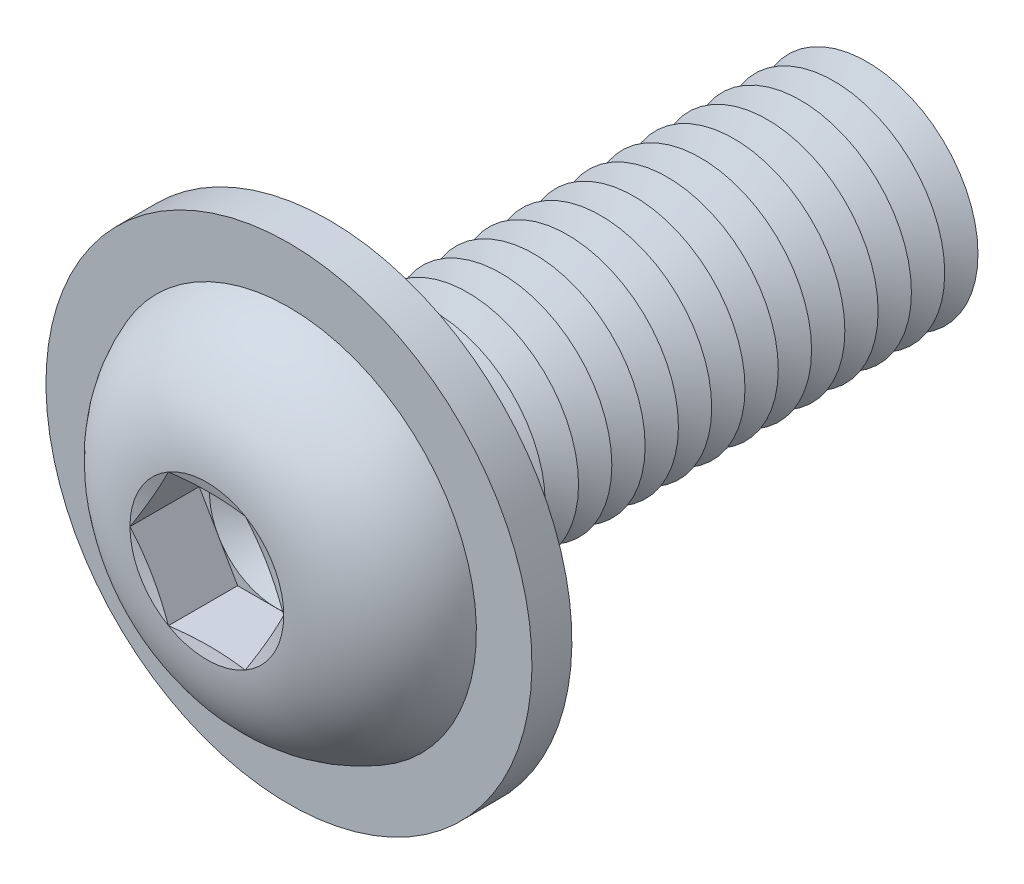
ISO-10303-21;
HEADER;
FILE_DESCRIPTION(('STEP AP214'),'2;1');
FILE_NAME('part.step','',(''),(''),'','','');
FILE_SCHEMA(('AUTOMOTIVE_DESIGN { 1 0 10303 214 1 1 1 1 }'));
ENDSEC;
DATA;
#1=APPLICATION_CONTEXT('core data for automotive mechanical design processes');
#2=APPLICATION_PROTOCOL_DEFINITION('international standard','automotive_design',2000,#1);
#3=PRODUCT_CONTEXT('',#1,'mechanical');
#4=PRODUCT('Part','Part','',(#3));
#5=PRODUCT_RELATED_PRODUCT_CATEGORY('part','',(#4));
#6=PRODUCT_DEFINITION_FORMATION('','',#4);
#7=PRODUCT_DEFINITION_CONTEXT('part definition',#1,'design');
#8=PRODUCT_DEFINITION('design','',#6,#7);
#9=PRODUCT_DEFINITION_SHAPE('','',#8);
#10=(LENGTH_UNIT() NAMED_UNIT(*) SI_UNIT(.MILLI.,.METRE.));
#11=(NAMED_UNIT(*) PLANE_ANGLE_UNIT() SI_UNIT($,.RADIAN.));
#12=(NAMED_UNIT(*) SI_UNIT($,.STERADIAN.) SOLID_ANGLE_UNIT());
#13=UNCERTAINTY_MEASURE_WITH_UNIT(LENGTH_MEASURE(1.E-05),#10,'distance_accuracy_value','');
#14=(GEOMETRIC_REPRESENTATION_CONTEXT(3) GLOBAL_UNCERTAINTY_ASSIGNED_CONTEXT((#13)) GLOBAL_UNIT_ASSIGNED_CONTEXT((#10,
#11,#12)) REPRESENTATION_CONTEXT('',''));
#15=CARTESIAN_POINT('',(0.,0.,0.));
#16=DIRECTION('',(0.,0.,1.));
#17=DIRECTION('',(1.,0.,0.));
#18=AXIS2_PLACEMENT_3D('',#15,#16,#17);
#19=CARTESIAN_POINT('',(0.,0.,-19.75));
#20=DIRECTION('',(0.,0.,1.));
#21=DIRECTION('',(1.,0.,0.));
#22=AXIS2_PLACEMENT_3D('',#19,#20,#21);
#23=CONICAL_SURFACE('',#22,5.,1.0471975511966);
#24=CARTESIAN_POINT('',(0.,0.,-20.5));
#25=DIRECTION('',(0.,0.,1.));
#26=DIRECTION('',(1.,0.,0.));
#27=AXIS2_PLACEMENT_3D('',#24,#25,#26);
#28=CIRCLE('',#27,3.70096189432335);
#29=CARTESIAN_POINT('',(3.70096189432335,0.,-20.5));
#30=VERTEX_POINT('',#29);
#31=EDGE_CURVE('E363',#30,#30,#28,.T.);
#32=ORIENTED_EDGE('',*,*,#31,.T.);
#33=EDGE_LOOP('',(#32));
#34=FACE_BOUND('',#33,.T.);
#35=CARTESIAN_POINT('',(0.,0.,-19.75));
#36=DIRECTION('',(0.,0.,1.));
#37=DIRECTION('',(1.,0.,0.));
#38=AXIS2_PLACEMENT_3D('',#35,#36,#37);
#39=CIRCLE('',#38,5.);
#40=CARTESIAN_POINT('',(5.,0.,-19.75));
#41=VERTEX_POINT('',#40);
#42=EDGE_CURVE('E337',#41,#41,#39,.T.);
#43=ORIENTED_EDGE('',*,*,#42,.F.);
#44=EDGE_LOOP('',(#43));
#45=FACE_BOUND('',#44,.T.);
#46=ADVANCED_FACE('F39',(#34,#45),#23,.T.);
#47=CARTESIAN_POINT('',(0.,0.,-20.5));
#48=DIRECTION('',(0.,0.,-1.));
#49=DIRECTION('',(-1.,0.,0.));
#50=AXIS2_PLACEMENT_3D('',#47,#48,#49);
#51=CONICAL_SURFACE('',#50,3.70096189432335,1.0471975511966);
#52=CARTESIAN_POINT('',(0.,0.,-21.25));
#53=DIRECTION('',(0.,0.,1.));
#54=DIRECTION('',(1.,0.,0.));
#55=AXIS2_PLACEMENT_3D('',#52,#53,#54);
#56=CIRCLE('',#55,5.);
#57=CARTESIAN_POINT('',(5.,0.,-21.25));
#58=VERTEX_POINT('',#57);
#59=EDGE_CURVE('E359',#58,#58,#56,.T.);
#60=ORIENTED_EDGE('',*,*,#59,.T.);
#61=EDGE_LOOP('',(#60));
#62=FACE_BOUND('',#61,.T.);
#63=ORIENTED_EDGE('',*,*,#31,.F.);
#64=EDGE_LOOP('',(#63));
#65=FACE_BOUND('',#64,.T.);
#66=ADVANCED_FACE('F433',(#62,#65),#51,.T.);
#67=CARTESIAN_POINT('',(0.,5.00000000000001,-25.));
#68=DIRECTION('',(0.,0.,-1.));
#69=DIRECTION('',(-1.,0.,0.));
#70=AXIS2_PLACEMENT_3D('',#67,#68,#69);
#71=PLANE('',#70);
#72=CARTESIAN_POINT('',(0.,0.,-25.));
#73=DIRECTION('',(0.,0.,1.));
#74=DIRECTION('',(1.,0.,0.));
#75=AXIS2_PLACEMENT_3D('',#72,#73,#74);
#76=CIRCLE('',#75,3.70096189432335);
#77=CARTESIAN_POINT('',(3.70096189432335,0.,-25.));
#78=VERTEX_POINT('',#77);
#79=EDGE_CURVE('E307',#78,#78,#76,.T.);
#80=ORIENTED_EDGE('',*,*,#79,.F.);
#81=EDGE_LOOP('',(#80));
#82=FACE_BOUND('',#81,.T.);
#83=ADVANCED_FACE('F431',(#82),#71,.T.);
#84=CARTESIAN_POINT('',(0.,0.,-24.25));
#85=DIRECTION('',(0.,0.,1.));
#86=DIRECTION('',(1.,0.,0.));
#87=AXIS2_PLACEMENT_3D('',#84,#85,#86);
#88=CONICAL_SURFACE('',#87,5.,1.0471975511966);
#89=ORIENTED_EDGE('',*,*,#79,.T.);
#90=EDGE_LOOP('',(#89));
#91=FACE_BOUND('',#90,.T.);
#92=CARTESIAN_POINT('',(0.,0.,-24.25));
#93=DIRECTION('',(0.,0.,1.));
#94=DIRECTION('',(1.,0.,0.));
#95=AXIS2_PLACEMENT_3D('',#92,#93,#94);
#96=CIRCLE('',#95,5.);
#97=CARTESIAN_POINT('',(5.,0.,-24.25));
#98=VERTEX_POINT('',#97);
#99=EDGE_CURVE('E416',#98,#98,#96,.T.);
#100=ORIENTED_EDGE('',*,*,#99,.F.);
#101=EDGE_LOOP('',(#100));
#102=FACE_BOUND('',#101,.T.);
#103=ADVANCED_FACE('F428',(#91,#102),#88,.T.);
#104=CARTESIAN_POINT('',(0.,0.,-23.5));
#105=DIRECTION('',(0.,0.,-1.));
#106=DIRECTION('',(-1.,0.,0.));
#107=AXIS2_PLACEMENT_3D('',#104,#105,#106);
#108=CONICAL_SURFACE('',#107,3.70096189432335,1.0471975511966);
#109=ORIENTED_EDGE('',*,*,#99,.T.);
#110=EDGE_LOOP('',(#109));
#111=FACE_BOUND('',#110,.T.);
#112=CARTESIAN_POINT('',(0.,0.,-23.5));
#113=DIRECTION('',(0.,0.,1.));
#114=DIRECTION('',(1.,0.,0.));
#115=AXIS2_PLACEMENT_3D('',#112,#113,#114);
#116=CIRCLE('',#115,3.70096189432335);
#117=CARTESIAN_POINT('',(3.70096189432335,0.,-23.5));
#118=VERTEX_POINT('',#117);
#119=EDGE_CURVE('E413',#118,#118,#116,.T.);
#120=ORIENTED_EDGE('',*,*,#119,.F.);
#121=EDGE_LOOP('',(#120));
#122=FACE_BOUND('',#121,.T.);
#123=ADVANCED_FACE('F438',(#111,#122),#108,.T.);
#124=CARTESIAN_POINT('',(0.,0.,-22.75));
#125=DIRECTION('',(0.,0.,1.));
#126=DIRECTION('',(1.,0.,0.));
#127=AXIS2_PLACEMENT_3D('',#124,#125,#126);
#128=CONICAL_SURFACE('',#127,5.,1.0471975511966);
#129=ORIENTED_EDGE('',*,*,#119,.T.);
#130=EDGE_LOOP('',(#129));
#131=FACE_BOUND('',#130,.T.);
#132=CARTESIAN_POINT('',(0.,0.,-22.75));
#133=DIRECTION('',(0.,0.,1.));
#134=DIRECTION('',(1.,0.,0.));
#135=AXIS2_PLACEMENT_3D('',#132,#133,#134);
#136=CIRCLE('',#135,5.);
#137=CARTESIAN_POINT('',(5.,0.,-22.75));
#138=VERTEX_POINT('',#137);
#139=EDGE_CURVE('E409',#138,#138,#136,.T.);
#140=ORIENTED_EDGE('',*,*,#139,.F.);
#141=EDGE_LOOP('',(#140));
#142=FACE_BOUND('',#141,.T.);
#143=ADVANCED_FACE('F454',(#131,#142),#128,.T.);
#144=CARTESIAN_POINT('',(0.,0.,-22.));
#145=DIRECTION('',(0.,0.,-1.));
#146=DIRECTION('',(-1.,0.,0.));
#147=AXIS2_PLACEMENT_3D('',#144,#145,#146);
#148=CONICAL_SURFACE('',#147,3.70096189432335,1.0471975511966);
#149=ORIENTED_EDGE('',*,*,#139,.T.);
#150=EDGE_LOOP('',(#149));
#151=FACE_BOUND('',#150,.T.);
#152=CARTESIAN_POINT('',(0.,0.,-22.));
#153=DIRECTION('',(0.,0.,1.));
#154=DIRECTION('',(1.,0.,0.));
#155=AXIS2_PLACEMENT_3D('',#152,#153,#154);
#156=CIRCLE('',#155,3.70096189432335);
#157=CARTESIAN_POINT('',(3.70096189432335,0.,-22.));
#158=VERTEX_POINT('',#157);
#159=EDGE_CURVE('E362',#158,#158,#156,.T.);
#160=ORIENTED_EDGE('',*,*,#159,.F.);
#161=EDGE_LOOP('',(#160));
#162=FACE_BOUND('',#161,.T.);
#163=ADVANCED_FACE('F450',(#151,#162),#148,.T.);
#164=CARTESIAN_POINT('',(0.,0.,-21.25));
#165=DIRECTION('',(0.,0.,1.));
#166=DIRECTION('',(1.,0.,0.));
#167=AXIS2_PLACEMENT_3D('',#164,#165,#166);
#168=CONICAL_SURFACE('',#167,5.,1.0471975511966);
#169=ORIENTED_EDGE('',*,*,#159,.T.);
#170=EDGE_LOOP('',(#169));
#171=FACE_BOUND('',#170,.T.);
#172=ORIENTED_EDGE('',*,*,#59,.F.);
#173=EDGE_LOOP('',(#172));
#174=FACE_BOUND('',#173,.T.);
#175=ADVANCED_FACE('F453',(#171,#174),#168,.T.);
#176=CARTESIAN_POINT('',(0.,0.,-18.25));
#177=DIRECTION('',(0.,0.,1.));
#178=DIRECTION('',(1.,0.,0.));
#179=AXIS2_PLACEMENT_3D('',#176,#177,#178);
#180=CONICAL_SURFACE('',#179,5.,1.0471975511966);
#181=CARTESIAN_POINT('',(0.,0.,-19.));
#182=DIRECTION('',(0.,0.,1.));
#183=DIRECTION('',(1.,0.,0.));
#184=AXIS2_PLACEMENT_3D('',#181,#182,#183);
#185=CIRCLE('',#184,3.70096189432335);
#186=CARTESIAN_POINT('',(3.70096189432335,0.,-19.));
#187=VERTEX_POINT('',#186);
#188=EDGE_CURVE('E334',#187,#187,#185,.T.);
#189=ORIENTED_EDGE('',*,*,#188,.T.);
#190=EDGE_LOOP('',(#189));
#191=FACE_BOUND('',#190,.T.);
#192=CARTESIAN_POINT('',(0.,0.,-18.25));
#193=DIRECTION('',(0.,0.,1.));
#194=DIRECTION('',(1.,0.,0.));
#195=AXIS2_PLACEMENT_3D('',#192,#193,#194);
#196=CIRCLE('',#195,5.);
#197=CARTESIAN_POINT('',(5.,0.,-18.25));
#198=VERTEX_POINT('',#197);
#199=EDGE_CURVE('E338',#198,#198,#196,.T.);
#200=ORIENTED_EDGE('',*,*,#199,.F.);
#201=EDGE_LOOP('',(#200));
#202=FACE_BOUND('',#201,.T.);
#203=ADVANCED_FACE('F458',(#191,#202),#180,.T.);
#204=CARTESIAN_POINT('',(0.,0.,-19.));
#205=DIRECTION('',(0.,0.,-1.));
#206=DIRECTION('',(-1.,0.,0.));
#207=AXIS2_PLACEMENT_3D('',#204,#205,#206);
#208=CONICAL_SURFACE('',#207,3.70096189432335,1.0471975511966);
#209=ORIENTED_EDGE('',*,*,#42,.T.);
#210=EDGE_LOOP('',(#209));
#211=FACE_BOUND('',#210,.T.);
#212=ORIENTED_EDGE('',*,*,#188,.F.);
#213=EDGE_LOOP('',(#212));
#214=FACE_BOUND('',#213,.T.);
#215=ADVANCED_FACE('F489',(#211,#214),#208,.T.);
#216=CARTESIAN_POINT('',(0.,0.,-16.75));
#217=DIRECTION('',(0.,0.,1.));
#218=DIRECTION('',(1.,0.,0.));
#219=AXIS2_PLACEMENT_3D('',#216,#217,#218);
#220=CONICAL_SURFACE('',#219,5.,1.0471975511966);
#221=CARTESIAN_POINT('',(0.,0.,-17.5));
#222=DIRECTION('',(0.,0.,1.));
#223=DIRECTION('',(1.,0.,0.));
#224=AXIS2_PLACEMENT_3D('',#221,#222,#223);
#225=CIRCLE('',#224,3.70096189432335);
#226=CARTESIAN_POINT('',(3.70096189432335,0.,-17.5));
#227=VERTEX_POINT('',#226);
#228=EDGE_CURVE('E330',#227,#227,#225,.T.);
#229=ORIENTED_EDGE('',*,*,#228,.T.);
#230=EDGE_LOOP('',(#229));
#231=FACE_BOUND('',#230,.T.);
#232=CARTESIAN_POINT('',(0.,0.,-16.75));
#233=DIRECTION('',(0.,0.,1.));
#234=DIRECTION('',(1.,0.,0.));
#235=AXIS2_PLACEMENT_3D('',#232,#233,#234);
#236=CIRCLE('',#235,5.);
#237=CARTESIAN_POINT('',(5.,0.,-16.75));
#238=VERTEX_POINT('',#237);
#239=EDGE_CURVE('E327',#238,#238,#236,.T.);
#240=ORIENTED_EDGE('',*,*,#239,.F.);
#241=EDGE_LOOP('',(#240));
#242=FACE_BOUND('',#241,.T.);
#243=ADVANCED_FACE('F495',(#231,#242),#220,.T.);
#244=CARTESIAN_POINT('',(0.,0.,-17.5));
#245=DIRECTION('',(0.,0.,-1.));
#246=DIRECTION('',(-1.,0.,0.));
#247=AXIS2_PLACEMENT_3D('',#244,#245,#246);
#248=CONICAL_SURFACE('',#247,3.70096189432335,1.0471975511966);
#249=ORIENTED_EDGE('',*,*,#199,.T.);
#250=EDGE_LOOP('',(#249));
#251=FACE_BOUND('',#250,.T.);
#252=ORIENTED_EDGE('',*,*,#228,.F.);
#253=EDGE_LOOP('',(#252));
#254=FACE_BOUND('',#253,.T.);
#255=ADVANCED_FACE('F502',(#251,#254),#248,.T.);
#256=CARTESIAN_POINT('',(0.,0.,-15.25));
#257=DIRECTION('',(0.,0.,1.));
#258=DIRECTION('',(1.,0.,0.));
#259=AXIS2_PLACEMENT_3D('',#256,#257,#258);
#260=CONICAL_SURFACE('',#259,5.,1.0471975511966);
#261=CARTESIAN_POINT('',(0.,0.,-16.));
#262=DIRECTION('',(0.,0.,1.));
#263=DIRECTION('',(1.,0.,0.));
#264=AXIS2_PLACEMENT_3D('',#261,#262,#263);
#265=CIRCLE('',#264,3.70096189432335);
#266=CARTESIAN_POINT('',(3.70096189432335,0.,-16.));
#267=VERTEX_POINT('',#266);
#268=EDGE_CURVE('E331',#267,#267,#265,.T.);
#269=ORIENTED_EDGE('',*,*,#268,.T.);
#270=EDGE_LOOP('',(#269));
#271=FACE_BOUND('',#270,.T.);
#272=CARTESIAN_POINT('',(0.,0.,-15.25));
#273=DIRECTION('',(0.,0.,1.));
#274=DIRECTION('',(1.,0.,0.));
#275=AXIS2_PLACEMENT_3D('',#272,#273,#274);
#276=CIRCLE('',#275,5.);
#277=CARTESIAN_POINT('',(5.,0.,-15.25));
#278=VERTEX_POINT('',#277);
#279=EDGE_CURVE('E343',#278,#278,#276,.T.);
#280=ORIENTED_EDGE('',*,*,#279,.F.);
#281=EDGE_LOOP('',(#280));
#282=FACE_BOUND('',#281,.T.);
#283=ADVANCED_FACE('F509',(#271,#282),#260,.T.);
#284=CARTESIAN_POINT('',(0.,0.,-16.));
#285=DIRECTION('',(0.,0.,-1.));
#286=DIRECTION('',(-1.,0.,0.));
#287=AXIS2_PLACEMENT_3D('',#284,#285,#286);
#288=CONICAL_SURFACE('',#287,3.70096189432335,1.0471975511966);
#289=ORIENTED_EDGE('',*,*,#239,.T.);
#290=EDGE_LOOP('',(#289));
#291=FACE_BOUND('',#290,.T.);
#292=ORIENTED_EDGE('',*,*,#268,.F.);
#293=EDGE_LOOP('',(#292));
#294=FACE_BOUND('',#293,.T.);
#295=ADVANCED_FACE('F516',(#291,#294),#288,.T.);
#296=CARTESIAN_POINT('',(0.,0.,-13.75));
#297=DIRECTION('',(0.,0.,1.));
#298=DIRECTION('',(1.,0.,0.));
#299=AXIS2_PLACEMENT_3D('',#296,#297,#298);
#300=CONICAL_SURFACE('',#299,5.,1.0471975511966);
#301=CARTESIAN_POINT('',(0.,0.,-14.5));
#302=DIRECTION('',(0.,0.,1.));
#303=DIRECTION('',(1.,0.,0.));
#304=AXIS2_PLACEMENT_3D('',#301,#302,#303);
#305=CIRCLE('',#304,3.70096189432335);
#306=CARTESIAN_POINT('',(3.70096189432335,0.,-14.5));
#307=VERTEX_POINT('',#306);
#308=EDGE_CURVE('E340',#307,#307,#305,.T.);
#309=ORIENTED_EDGE('',*,*,#308,.T.);
#310=EDGE_LOOP('',(#309));
#311=FACE_BOUND('',#310,.T.);
#312=CARTESIAN_POINT('',(0.,0.,-13.75));
#313=DIRECTION('',(0.,0.,1.));
#314=DIRECTION('',(1.,0.,0.));
#315=AXIS2_PLACEMENT_3D('',#312,#313,#314);
#316=CIRCLE('',#315,5.);
#317=CARTESIAN_POINT('',(5.,0.,-13.75));
#318=VERTEX_POINT('',#317);
#319=EDGE_CURVE('E344',#318,#318,#316,.T.);
#320=ORIENTED_EDGE('',*,*,#319,.F.);
#321=EDGE_LOOP('',(#320));
#322=FACE_BOUND('',#321,.T.);
#323=ADVANCED_FACE('F523',(#311,#322),#300,.T.);
#324=CARTESIAN_POINT('',(0.,0.,-14.5));
#325=DIRECTION('',(0.,0.,-1.));
#326=DIRECTION('',(-1.,0.,0.));
#327=AXIS2_PLACEMENT_3D('',#324,#325,#326);
#328=CONICAL_SURFACE('',#327,3.70096189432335,1.0471975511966);
#329=ORIENTED_EDGE('',*,*,#279,.T.);
#330=EDGE_LOOP('',(#329));
#331=FACE_BOUND('',#330,.T.);
#332=ORIENTED_EDGE('',*,*,#308,.F.);
#333=EDGE_LOOP('',(#332));
#334=FACE_BOUND('',#333,.T.);
#335=ADVANCED_FACE('F530',(#331,#334),#328,.T.);
#336=CARTESIAN_POINT('',(0.,0.,-12.25));
#337=DIRECTION('',(0.,0.,1.));
#338=DIRECTION('',(1.,0.,0.));
#339=AXIS2_PLACEMENT_3D('',#336,#337,#338);
#340=CONICAL_SURFACE('',#339,5.,1.0471975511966);
#341=CARTESIAN_POINT('',(0.,0.,-13.));
#342=DIRECTION('',(0.,0.,1.));
#343=DIRECTION('',(1.,0.,0.));
#344=AXIS2_PLACEMENT_3D('',#341,#342,#343);
#345=CIRCLE('',#344,3.70096189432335);
#346=CARTESIAN_POINT('',(3.70096189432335,0.,-13.));
#347=VERTEX_POINT('',#346);
#348=EDGE_CURVE('E375',#347,#347,#345,.T.);
#349=ORIENTED_EDGE('',*,*,#348,.T.);
#350=EDGE_LOOP('',(#349));
#351=FACE_BOUND('',#350,.T.);
#352=CARTESIAN_POINT('',(0.,0.,-12.25));
#353=DIRECTION('',(0.,0.,1.));
#354=DIRECTION('',(1.,0.,0.));
#355=AXIS2_PLACEMENT_3D('',#352,#353,#354);
#356=CIRCLE('',#355,5.);
#357=CARTESIAN_POINT('',(5.,0.,-12.25));
#358=VERTEX_POINT('',#357);
#359=EDGE_CURVE('E373',#358,#358,#356,.T.);
#360=ORIENTED_EDGE('',*,*,#359,.F.);
#361=EDGE_LOOP('',(#360));
#362=FACE_BOUND('',#361,.T.);
#363=ADVANCED_FACE('F537',(#351,#362),#340,.T.);
#364=CARTESIAN_POINT('',(0.,0.,-13.));
#365=DIRECTION('',(0.,0.,-1.));
#366=DIRECTION('',(-1.,0.,0.));
#367=AXIS2_PLACEMENT_3D('',#364,#365,#366);
#368=CONICAL_SURFACE('',#367,3.70096189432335,1.0471975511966);
#369=ORIENTED_EDGE('',*,*,#319,.T.);
#370=EDGE_LOOP('',(#369));
#371=FACE_BOUND('',#370,.T.);
#372=ORIENTED_EDGE('',*,*,#348,.F.);
#373=EDGE_LOOP('',(#372));
#374=FACE_BOUND('',#373,.T.);
#375=ADVANCED_FACE('F544',(#371,#374),#368,.T.);
#376=CARTESIAN_POINT('',(0.,0.,-10.75));
#377=DIRECTION('',(0.,0.,1.));
#378=DIRECTION('',(1.,0.,0.));
#379=AXIS2_PLACEMENT_3D('',#376,#377,#378);
#380=CONICAL_SURFACE('',#379,5.,1.0471975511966);
#381=CARTESIAN_POINT('',(0.,0.,-11.5));
#382=DIRECTION('',(0.,0.,1.));
#383=DIRECTION('',(1.,0.,0.));
#384=AXIS2_PLACEMENT_3D('',#381,#382,#383);
#385=CIRCLE('',#384,3.70096189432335);
#386=CARTESIAN_POINT('',(3.70096189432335,0.,-11.5));
#387=VERTEX_POINT('',#386);
#388=EDGE_CURVE('E376',#387,#387,#385,.T.);
#389=ORIENTED_EDGE('',*,*,#388,.T.);
#390=EDGE_LOOP('',(#389));
#391=FACE_BOUND('',#390,.T.);
#392=CARTESIAN_POINT('',(0.,0.,-10.75));
#393=DIRECTION('',(0.,0.,1.));
#394=DIRECTION('',(1.,0.,0.));
#395=AXIS2_PLACEMENT_3D('',#392,#393,#394);
#396=CIRCLE('',#395,5.);
#397=CARTESIAN_POINT('',(5.,0.,-10.75));
#398=VERTEX_POINT('',#397);
#399=EDGE_CURVE('E385',#398,#398,#396,.T.);
#400=ORIENTED_EDGE('',*,*,#399,.F.);
#401=EDGE_LOOP('',(#400));
#402=FACE_BOUND('',#401,.T.);
#403=ADVANCED_FACE('F551',(#391,#402),#380,.T.);
#404=CARTESIAN_POINT('',(0.,0.,-11.5));
#405=DIRECTION('',(0.,0.,-1.));
#406=DIRECTION('',(-1.,0.,0.));
#407=AXIS2_PLACEMENT_3D('',#404,#405,#406);
#408=CONICAL_SURFACE('',#407,3.70096189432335,1.0471975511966);
#409=ORIENTED_EDGE('',*,*,#359,.T.);
#410=EDGE_LOOP('',(#409));
#411=FACE_BOUND('',#410,.T.);
#412=ORIENTED_EDGE('',*,*,#388,.F.);
#413=EDGE_LOOP('',(#412));
#414=FACE_BOUND('',#413,.T.);
#415=ADVANCED_FACE('F558',(#411,#414),#408,.T.);
#416=CARTESIAN_POINT('',(0.,0.,-9.25));
#417=DIRECTION('',(0.,0.,1.));
#418=DIRECTION('',(1.,0.,0.));
#419=AXIS2_PLACEMENT_3D('',#416,#417,#418);
#420=CONICAL_SURFACE('',#419,5.,1.0471975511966);
#421=CARTESIAN_POINT('',(0.,0.,-10.));
#422=DIRECTION('',(0.,0.,1.));
#423=DIRECTION('',(1.,0.,0.));
#424=AXIS2_PLACEMENT_3D('',#421,#422,#423);
#425=CIRCLE('',#424,3.70096189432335);
#426=CARTESIAN_POINT('',(3.70096189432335,0.,-10.));
#427=VERTEX_POINT('',#426);
#428=EDGE_CURVE('E1056',#427,#427,#425,.T.);
#429=ORIENTED_EDGE('',*,*,#428,.T.);
#430=EDGE_LOOP('',(#429));
#431=FACE_BOUND('',#430,.T.);
#432=CARTESIAN_POINT('',(0.,0.,-9.25));
#433=DIRECTION('',(0.,0.,1.));
#434=DIRECTION('',(1.,0.,0.));
#435=AXIS2_PLACEMENT_3D('',#432,#433,#434);
#436=CIRCLE('',#435,5.);
#437=CARTESIAN_POINT('',(5.,0.,-9.25));
#438=VERTEX_POINT('',#437);
#439=EDGE_CURVE('E367',#438,#438,#436,.T.);
#440=ORIENTED_EDGE('',*,*,#439,.F.);
#441=EDGE_LOOP('',(#440));
#442=FACE_BOUND('',#441,.T.);
#443=ADVANCED_FACE('F565',(#431,#442),#420,.T.);
#444=CARTESIAN_POINT('',(0.,0.,-10.));
#445=DIRECTION('',(0.,0.,-1.));
#446=DIRECTION('',(-1.,0.,0.));
#447=AXIS2_PLACEMENT_3D('',#444,#445,#446);
#448=CONICAL_SURFACE('',#447,3.70096189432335,1.0471975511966);
#449=ORIENTED_EDGE('',*,*,#399,.T.);
#450=EDGE_LOOP('',(#449));
#451=FACE_BOUND('',#450,.T.);
#452=ORIENTED_EDGE('',*,*,#428,.F.);
#453=EDGE_LOOP('',(#452));
#454=FACE_BOUND('',#453,.T.);
#455=ADVANCED_FACE('F571',(#451,#454),#448,.T.);
#456=CARTESIAN_POINT('',(0.,0.,-7.75));
#457=DIRECTION('',(0.,0.,1.));
#458=DIRECTION('',(1.,0.,0.));
#459=AXIS2_PLACEMENT_3D('',#456,#457,#458);
#460=CONICAL_SURFACE('',#459,5.,1.0471975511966);
#461=CARTESIAN_POINT('',(0.,0.,-8.5));
#462=DIRECTION('',(0.,0.,1.));
#463=DIRECTION('',(1.,0.,0.));
#464=AXIS2_PLACEMENT_3D('',#461,#462,#463);
#465=CIRCLE('',#464,3.70096189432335);
#466=CARTESIAN_POINT('',(3.70096189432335,0.,-8.5));
#467=VERTEX_POINT('',#466);
#468=EDGE_CURVE('E355',#467,#467,#465,.T.);
#469=ORIENTED_EDGE('',*,*,#468,.T.);
#470=EDGE_LOOP('',(#469));
#471=FACE_BOUND('',#470,.T.);
#472=CARTESIAN_POINT('',(0.,0.,-7.75));
#473=DIRECTION('',(0.,0.,1.));
#474=DIRECTION('',(1.,0.,0.));
#475=AXIS2_PLACEMENT_3D('',#472,#473,#474);
#476=CIRCLE('',#475,5.);
#477=CARTESIAN_POINT('',(5.,0.,-7.75));
#478=VERTEX_POINT('',#477);
#479=EDGE_CURVE('E352',#478,#478,#476,.T.);
#480=ORIENTED_EDGE('',*,*,#479,.F.);
#481=EDGE_LOOP('',(#480));
#482=FACE_BOUND('',#481,.T.);
#483=ADVANCED_FACE('F578',(#471,#482),#460,.T.);
#484=CARTESIAN_POINT('',(0.,0.,-8.5));
#485=DIRECTION('',(0.,0.,-1.));
#486=DIRECTION('',(-1.,0.,0.));
#487=AXIS2_PLACEMENT_3D('',#484,#485,#486);
#488=CONICAL_SURFACE('',#487,3.70096189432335,1.0471975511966);
#489=ORIENTED_EDGE('',*,*,#439,.T.);
#490=EDGE_LOOP('',(#489));
#491=FACE_BOUND('',#490,.T.);
#492=ORIENTED_EDGE('',*,*,#468,.F.);
#493=EDGE_LOOP('',(#492));
#494=FACE_BOUND('',#493,.T.);
#495=ADVANCED_FACE('F585',(#491,#494),#488,.T.);
#496=CARTESIAN_POINT('',(0.,0.,-6.25));
#497=DIRECTION('',(0.,0.,1.));
#498=DIRECTION('',(1.,0.,0.));
#499=AXIS2_PLACEMENT_3D('',#496,#497,#498);
#500=CONICAL_SURFACE('',#499,5.,1.0471975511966);
#501=CARTESIAN_POINT('',(0.,0.,-7.));
#502=DIRECTION('',(0.,0.,1.));
#503=DIRECTION('',(1.,0.,0.));
#504=AXIS2_PLACEMENT_3D('',#501,#502,#503);
#505=CIRCLE('',#504,3.70096189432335);
#506=CARTESIAN_POINT('',(3.70096189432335,0.,-7.));
#507=VERTEX_POINT('',#506);
#508=EDGE_CURVE('E356',#507,#507,#505,.T.);
#509=ORIENTED_EDGE('',*,*,#508,.T.);
#510=EDGE_LOOP('',(#509));
#511=FACE_BOUND('',#510,.T.);
#512=CARTESIAN_POINT('',(0.,0.,-6.25));
#513=DIRECTION('',(0.,0.,1.));
#514=DIRECTION('',(1.,0.,0.));
#515=AXIS2_PLACEMENT_3D('',#512,#513,#514);
#516=CIRCLE('',#515,5.);
#517=CARTESIAN_POINT('',(5.,0.,-6.25));
#518=VERTEX_POINT('',#517);
#519=EDGE_CURVE('E1060',#518,#518,#516,.T.);
#520=ORIENTED_EDGE('',*,*,#519,.F.);
#521=EDGE_LOOP('',(#520));
#522=FACE_BOUND('',#521,.T.);
#523=ADVANCED_FACE('F592',(#511,#522),#500,.T.);
#524=CARTESIAN_POINT('',(0.,0.,-7.));
#525=DIRECTION('',(0.,0.,-1.));
#526=DIRECTION('',(-1.,0.,0.));
#527=AXIS2_PLACEMENT_3D('',#524,#525,#526);
#528=CONICAL_SURFACE('',#527,3.70096189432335,1.0471975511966);
#529=ORIENTED_EDGE('',*,*,#479,.T.);
#530=EDGE_LOOP('',(#529));
#531=FACE_BOUND('',#530,.T.);
#532=ORIENTED_EDGE('',*,*,#508,.F.);
#533=EDGE_LOOP('',(#532));
#534=FACE_BOUND('',#533,.T.);
#535=ADVANCED_FACE('F599',(#531,#534),#528,.T.);
#536=CARTESIAN_POINT('',(0.,0.,-4.75));
#537=DIRECTION('',(0.,0.,1.));
#538=DIRECTION('',(1.,0.,0.));
#539=AXIS2_PLACEMENT_3D('',#536,#537,#538);
#540=CONICAL_SURFACE('',#539,5.,1.0471975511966);
#541=CARTESIAN_POINT('',(0.,0.,-5.5));
#542=DIRECTION('',(0.,0.,1.));
#543=DIRECTION('',(1.,0.,0.));
#544=AXIS2_PLACEMENT_3D('',#541,#542,#543);
#545=CIRCLE('',#544,3.70096189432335);
#546=CARTESIAN_POINT('',(3.70096189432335,0.,-5.5));
#547=VERTEX_POINT('',#546);
#548=EDGE_CURVE('E1053',#547,#547,#545,.T.);
#549=ORIENTED_EDGE('',*,*,#548,.T.);
#550=EDGE_LOOP('',(#549));
#551=FACE_BOUND('',#550,.T.);
#552=CARTESIAN_POINT('',(0.,0.,-4.75));
#553=DIRECTION('',(0.,0.,1.));
#554=DIRECTION('',(1.,0.,0.));
#555=AXIS2_PLACEMENT_3D('',#552,#553,#554);
#556=CIRCLE('',#555,5.);
#557=CARTESIAN_POINT('',(5.,0.,-4.75));
#558=VERTEX_POINT('',#557);
#559=EDGE_CURVE('E1050',#558,#558,#556,.T.);
#560=ORIENTED_EDGE('',*,*,#559,.F.);
#561=EDGE_LOOP('',(#560));
#562=FACE_BOUND('',#561,.T.);
#563=ADVANCED_FACE('F606',(#551,#562),#540,.T.);
#564=CARTESIAN_POINT('',(0.,0.,-5.5));
#565=DIRECTION('',(0.,0.,-1.));
#566=DIRECTION('',(-1.,0.,0.));
#567=AXIS2_PLACEMENT_3D('',#564,#565,#566);
#568=CONICAL_SURFACE('',#567,3.70096189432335,1.0471975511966);
#569=ORIENTED_EDGE('',*,*,#519,.T.);
#570=EDGE_LOOP('',(#569));
#571=FACE_BOUND('',#570,.T.);
#572=ORIENTED_EDGE('',*,*,#548,.F.);
#573=EDGE_LOOP('',(#572));
#574=FACE_BOUND('',#573,.T.);
#575=ADVANCED_FACE('F613',(#571,#574),#568,.T.);
#576=CARTESIAN_POINT('',(0.,0.,-3.25));
#577=DIRECTION('',(0.,0.,1.));
#578=DIRECTION('',(1.,0.,0.));
#579=AXIS2_PLACEMENT_3D('',#576,#577,#578);
#580=CONICAL_SURFACE('',#579,5.,1.0471975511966);
#581=CARTESIAN_POINT('',(0.,0.,-4.));
#582=DIRECTION('',(0.,0.,1.));
#583=DIRECTION('',(1.,0.,0.));
#584=AXIS2_PLACEMENT_3D('',#581,#582,#583);
#585=CIRCLE('',#584,3.70096189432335);
#586=CARTESIAN_POINT('',(3.70096189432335,0.,-4.));
#587=VERTEX_POINT('',#586);
#588=EDGE_CURVE('E1054',#587,#587,#585,.T.);
#589=ORIENTED_EDGE('',*,*,#588,.T.);
#590=EDGE_LOOP('',(#589));
#591=FACE_BOUND('',#590,.T.);
#592=CARTESIAN_POINT('',(0.,0.,-3.25));
#593=DIRECTION('',(0.,0.,1.));
#594=DIRECTION('',(1.,0.,0.));
#595=AXIS2_PLACEMENT_3D('',#592,#593,#594);
#596=CIRCLE('',#595,5.);
#597=CARTESIAN_POINT('',(5.,0.,-3.25));
#598=VERTEX_POINT('',#597);
#599=EDGE_CURVE('E1032',#598,#598,#596,.T.);
#600=ORIENTED_EDGE('',*,*,#599,.F.);
#601=EDGE_LOOP('',(#600));
#602=FACE_BOUND('',#601,.T.);
#603=ADVANCED_FACE('F620',(#591,#602),#580,.T.);
#604=CARTESIAN_POINT('',(0.,0.,-4.));
#605=DIRECTION('',(0.,0.,-1.));
#606=DIRECTION('',(-1.,0.,0.));
#607=AXIS2_PLACEMENT_3D('',#604,#605,#606);
#608=CONICAL_SURFACE('',#607,3.70096189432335,1.0471975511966);
#609=ORIENTED_EDGE('',*,*,#559,.T.);
#610=EDGE_LOOP('',(#609));
#611=FACE_BOUND('',#610,.T.);
#612=ORIENTED_EDGE('',*,*,#588,.F.);
#613=EDGE_LOOP('',(#612));
#614=FACE_BOUND('',#613,.T.);
#615=ADVANCED_FACE('F627',(#611,#614),#608,.T.);
#616=CARTESIAN_POINT('',(0.,0.,-1.75));
#617=DIRECTION('',(0.,0.,1.));
#618=DIRECTION('',(1.,0.,0.));
#619=AXIS2_PLACEMENT_3D('',#616,#617,#618);
#620=CONICAL_SURFACE('',#619,5.,1.0471975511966);
#621=CARTESIAN_POINT('',(0.,0.,-2.5));
#622=DIRECTION('',(0.,0.,1.));
#623=DIRECTION('',(1.,0.,0.));
#624=AXIS2_PLACEMENT_3D('',#621,#622,#623);
#625=CIRCLE('',#624,3.70096189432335);
#626=CARTESIAN_POINT('',(3.70096189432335,0.,-2.5));
#627=VERTEX_POINT('',#626);
#628=EDGE_CURVE('E227',#627,#627,#625,.T.);
#629=ORIENTED_EDGE('',*,*,#628,.T.);
#630=EDGE_LOOP('',(#629));
#631=FACE_BOUND('',#630,.T.);
#632=CARTESIAN_POINT('',(0.,0.,-1.75));
#633=DIRECTION('',(0.,0.,1.));
#634=DIRECTION('',(1.,0.,0.));
#635=AXIS2_PLACEMENT_3D('',#632,#633,#634);
#636=CIRCLE('',#635,5.);
#637=CARTESIAN_POINT('',(5.,0.,-1.75));
#638=VERTEX_POINT('',#637);
#639=EDGE_CURVE('E1034',#638,#638,#636,.T.);
#640=ORIENTED_EDGE('',*,*,#639,.F.);
#641=EDGE_LOOP('',(#640));
#642=FACE_BOUND('',#641,.T.);
#643=ADVANCED_FACE('F634',(#631,#642),#620,.T.);
#644=CARTESIAN_POINT('',(0.,0.,-2.5));
#645=DIRECTION('',(0.,0.,-1.));
#646=DIRECTION('',(-1.,0.,0.));
#647=AXIS2_PLACEMENT_3D('',#644,#645,#646);
#648=CONICAL_SURFACE('',#647,3.70096189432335,1.0471975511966);
#649=ORIENTED_EDGE('',*,*,#599,.T.);
#650=EDGE_LOOP('',(#649));
#651=FACE_BOUND('',#650,.T.);
#652=ORIENTED_EDGE('',*,*,#628,.F.);
#653=EDGE_LOOP('',(#652));
#654=FACE_BOUND('',#653,.T.);
#655=ADVANCED_FACE('F211',(#651,#654),#648,.T.);
#656=CARTESIAN_POINT('',(0.,5.,0.));
#657=DIRECTION('',(0.,0.,-1.));
#658=DIRECTION('',(-1.,0.,0.));
#659=AXIS2_PLACEMENT_3D('',#656,#657,#658);
#660=PLANE('',#659);
#661=CARTESIAN_POINT('',(0.,0.,0.));
#662=DIRECTION('',(0.,0.,-1.));
#663=DIRECTION('',(-1.,0.,0.));
#664=AXIS2_PLACEMENT_3D('',#661,#662,#663);
#665=CIRCLE('',#664,5.75000000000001);
#666=CARTESIAN_POINT('',(-5.75000000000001,0.,0.));
#667=VERTEX_POINT('',#666);
#668=EDGE_CURVE('E281',#667,#667,#665,.F.);
#669=ORIENTED_EDGE('',*,*,#668,.T.);
#670=EDGE_LOOP('',(#669));
#671=FACE_BOUND('',#670,.T.);
#672=CARTESIAN_POINT('',(0.,0.,0.));
#673=DIRECTION('',(0.,0.,-1.));
#674=DIRECTION('',(0.,1.,0.));
#675=AXIS2_PLACEMENT_3D('',#672,#673,#674);
#676=CIRCLE('',#675,10.95);
#677=CARTESIAN_POINT('',(0.,10.95,0.));
#678=VERTEX_POINT('',#677);
#679=EDGE_CURVE('E1021',#678,#678,#676,.T.);
#680=ORIENTED_EDGE('',*,*,#679,.T.);
#681=EDGE_LOOP('',(#680));
#682=FACE_BOUND('',#681,.T.);
#683=ADVANCED_FACE('F646',(#671,#682),#660,.T.);
#684=CARTESIAN_POINT('',(0.,0.,-0.750000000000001));
#685=DIRECTION('',(0.,0.,-1.));
#686=DIRECTION('',(-1.,0.,0.));
#687=AXIS2_PLACEMENT_3D('',#684,#685,#686);
#688=TOROIDAL_SURFACE('',#687,5.75000000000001,0.75);
#689=ORIENTED_EDGE('',*,*,#668,.F.);
#690=EDGE_LOOP('',(#689));
#691=FACE_BOUND('',#690,.T.);
#692=CARTESIAN_POINT('',(0.,0.,-0.750000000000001));
#693=DIRECTION('',(0.,0.,-1.));
#694=DIRECTION('',(-1.,0.,0.));
#695=AXIS2_PLACEMENT_3D('',#692,#693,#694);
#696=CIRCLE('',#695,5.00000000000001);
#697=CARTESIAN_POINT('',(-5.00000000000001,0.,-0.750000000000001));
#698=VERTEX_POINT('',#697);
#699=EDGE_CURVE('E287',#698,#698,#696,.T.);
#700=ORIENTED_EDGE('',*,*,#699,.F.);
#701=EDGE_LOOP('',(#700));
#702=FACE_BOUND('',#701,.T.);
#703=ADVANCED_FACE('F41',(#691,#702),#688,.F.);
#704=CARTESIAN_POINT('',(0.,0.,-25.));
#705=DIRECTION('',(0.,0.,-1.));
#706=DIRECTION('',(-1.,0.,0.));
#707=AXIS2_PLACEMENT_3D('',#704,#705,#706);
#708=CYLINDRICAL_SURFACE('',#707,5.00000000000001);
#709=ORIENTED_EDGE('',*,*,#699,.T.);
#710=EDGE_LOOP('',(#709));
#711=FACE_BOUND('',#710,.T.);
#712=ORIENTED_EDGE('',*,*,#639,.T.);
#713=EDGE_LOOP('',(#712));
#714=FACE_BOUND('',#713,.T.);
#715=ADVANCED_FACE('F657',(#711,#714),#708,.T.);
#716=CARTESIAN_POINT('',(0.,0.,1.8));
#717=DIRECTION('',(0.,0.,-1.));
#718=DIRECTION('',(0.,1.,0.));
#719=AXIS2_PLACEMENT_3D('',#716,#717,#718);
#720=CYLINDRICAL_SURFACE('',#719,10.95);
#721=CARTESIAN_POINT('',(0.,0.,1.8));
#722=DIRECTION('',(0.,0.,-1.));
#723=DIRECTION('',(0.,1.,0.));
#724=AXIS2_PLACEMENT_3D('',#721,#722,#723);
#725=CIRCLE('',#724,10.95);
#726=CARTESIAN_POINT('',(0.,10.95,1.8));
#727=VERTEX_POINT('',#726);
#728=EDGE_CURVE('E347',#727,#727,#725,.T.);
#729=ORIENTED_EDGE('',*,*,#728,.T.);
#730=EDGE_LOOP('',(#729));
#731=FACE_BOUND('',#730,.T.);
#732=ORIENTED_EDGE('',*,*,#679,.F.);
#733=EDGE_LOOP('',(#732));
#734=FACE_BOUND('',#733,.T.);
#735=ADVANCED_FACE('F663',(#731,#734),#720,.T.);
#736=CARTESIAN_POINT('',(0.,0.,1.8));
#737=DIRECTION('',(0.,0.,-1.));
#738=DIRECTION('',(0.,1.,0.));
#739=AXIS2_PLACEMENT_3D('',#736,#737,#738);
#740=PLANE('',#739);
#741=CARTESIAN_POINT('',(0.,0.,1.8));
#742=DIRECTION('',(0.,0.,-1.));
#743=DIRECTION('',(0.,1.,0.));
#744=AXIS2_PLACEMENT_3D('',#741,#742,#743);
#745=CIRCLE('',#744,8.44736706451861);
#746=CARTESIAN_POINT('',(0.,8.44736706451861,1.8));
#747=VERTEX_POINT('',#746);
#748=EDGE_CURVE('E43',#747,#747,#745,.F.);
#749=ORIENTED_EDGE('',*,*,#748,.F.);
#750=EDGE_LOOP('',(#749));
#751=FACE_BOUND('',#750,.T.);
#752=ORIENTED_EDGE('',*,*,#728,.F.);
#753=EDGE_LOOP('',(#752));
#754=FACE_BOUND('',#753,.T.);
#755=ADVANCED_FACE('F117',(#751,#754),#740,.F.);
#756=CARTESIAN_POINT('',(0.,0.,2.38));
#757=DIRECTION('',(0.,0.,1.));
#758=DIRECTION('',(1.,0.,0.));
#759=AXIS2_PLACEMENT_3D('',#756,#757,#758);
#760=CONICAL_SURFACE('',#759,2.99999860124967,1.0471975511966);
#761=CARTESIAN_POINT('',(0.,0.,0.64795000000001));
#762=VERTEX_POINT('',#761);
#763=VERTEX_LOOP('',#762);
#764=FACE_BOUND('',#763,.T.);
#765=CARTESIAN_POINT('',(0.,0.,2.38));
#766=DIRECTION('',(0.,0.,1.));
#767=DIRECTION('',(1.,0.,0.));
#768=AXIS2_PLACEMENT_3D('',#765,#766,#767);
#769=CIRCLE('',#768,2.99999860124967);
#770=CARTESIAN_POINT('',(2.598075,1.49999930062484,2.38));
#771=VERTEX_POINT('',#770);
#772=CARTESIAN_POINT('',(0.,2.99999860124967,2.38));
#773=VERTEX_POINT('',#772);
#774=EDGE_CURVE('E120',#771,#773,#769,.T.);
#775=ORIENTED_EDGE('',*,*,#774,.T.);
#776=CARTESIAN_POINT('',(0.,0.,2.38));
#777=DIRECTION('',(0.,0.,1.));
#778=DIRECTION('',(1.,0.,0.));
#779=AXIS2_PLACEMENT_3D('',#776,#777,#778);
#780=CIRCLE('',#779,2.99999860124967);
#781=CARTESIAN_POINT('',(-2.598075,1.49999930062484,2.38));
#782=VERTEX_POINT('',#781);
#783=EDGE_CURVE('E11',#773,#782,#780,.T.);
#784=ORIENTED_EDGE('',*,*,#783,.T.);
#785=CARTESIAN_POINT('',(-2.598075,-1.49999930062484,2.38));
#786=VERTEX_POINT('',#785);
#787=EDGE_CURVE('E49',#782,#786,#780,.T.);
#788=ORIENTED_EDGE('',*,*,#787,.T.);
#789=CARTESIAN_POINT('',(0.,-2.99999860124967,2.38));
#790=VERTEX_POINT('',#789);
#791=EDGE_CURVE('E284',#786,#790,#780,.T.);
#792=ORIENTED_EDGE('',*,*,#791,.T.);
#793=CARTESIAN_POINT('',(2.598075,-1.49999930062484,2.38));
#794=VERTEX_POINT('',#793);
#795=EDGE_CURVE('E57',#790,#794,#780,.T.);
#796=ORIENTED_EDGE('',*,*,#795,.T.);
#797=EDGE_CURVE('E50',#794,#771,#780,.T.);
#798=ORIENTED_EDGE('',*,*,#797,.T.);
#799=EDGE_LOOP('',(#775,#784,#788,#792,#796,#798));
#800=FACE_BOUND('',#799,.T.);
#801=ADVANCED_FACE('F114',(#764,#800),#760,.F.);
#802=CARTESIAN_POINT('',(0.,0.,2.38));
#803=DIRECTION('',(0.,0.,1.));
#804=DIRECTION('',(1.,0.,0.));
#805=AXIS2_PLACEMENT_3D('',#802,#803,#804);
#806=PLANE('',#805);
#807=ORIENTED_EDGE('',*,*,#791,.F.);
#808=DIRECTION('',(0.5,-0.866025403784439,0.));
#809=VECTOR('',#808,1.);
#810=CARTESIAN_POINT('',(-3.4641,0.,2.38));
#811=LINE('',#810,#809);
#812=CARTESIAN_POINT('',(-1.73205,-2.99999860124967,2.38));
#813=VERTEX_POINT('',#812);
#814=EDGE_CURVE('E154',#786,#813,#811,.T.);
#815=ORIENTED_EDGE('',*,*,#814,.T.);
#816=DIRECTION('',(1.,0.,0.));
#817=VECTOR('',#816,1.);
#818=CARTESIAN_POINT('',(-1.73205,-2.99999860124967,2.38));
#819=LINE('',#818,#817);
#820=EDGE_CURVE('E160',#813,#790,#819,.T.);
#821=ORIENTED_EDGE('',*,*,#820,.T.);
#822=EDGE_LOOP('',(#807,#815,#821));
#823=FACE_BOUND('',#822,.T.);
#824=ADVANCED_FACE('F116',(#823),#806,.T.);
#825=ORIENTED_EDGE('',*,*,#795,.F.);
#826=CARTESIAN_POINT('',(1.73205,-2.99999860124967,2.38));
#827=VERTEX_POINT('',#826);
#828=EDGE_CURVE('E159',#790,#827,#819,.T.);
#829=ORIENTED_EDGE('',*,*,#828,.T.);
#830=DIRECTION('',(0.5,0.866025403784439,0.));
#831=VECTOR('',#830,1.);
#832=CARTESIAN_POINT('',(1.73205,-2.99999860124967,2.38));
#833=LINE('',#832,#831);
#834=EDGE_CURVE('E165',#827,#794,#833,.T.);
#835=ORIENTED_EDGE('',*,*,#834,.T.);
#836=EDGE_LOOP('',(#825,#829,#835));
#837=FACE_BOUND('',#836,.T.);
#838=ADVANCED_FACE('F684',(#837),#806,.T.);
#839=ORIENTED_EDGE('',*,*,#797,.F.);
#840=CARTESIAN_POINT('',(3.4641,0.,2.38));
#841=VERTEX_POINT('',#840);
#842=EDGE_CURVE('E164',#794,#841,#833,.T.);
#843=ORIENTED_EDGE('',*,*,#842,.T.);
#844=DIRECTION('',(-0.5,0.866025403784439,0.));
#845=VECTOR('',#844,1.);
#846=CARTESIAN_POINT('',(3.4641,0.,2.38));
#847=LINE('',#846,#845);
#848=EDGE_CURVE('E142',#841,#771,#847,.T.);
#849=ORIENTED_EDGE('',*,*,#848,.T.);
#850=EDGE_LOOP('',(#839,#843,#849));
#851=FACE_BOUND('',#850,.T.);
#852=ADVANCED_FACE('F690',(#851),#806,.T.);
#853=ORIENTED_EDGE('',*,*,#774,.F.);
#854=CARTESIAN_POINT('',(1.73205,2.99999860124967,2.38));
#855=VERTEX_POINT('',#854);
#856=EDGE_CURVE('E127',#771,#855,#847,.T.);
#857=ORIENTED_EDGE('',*,*,#856,.T.);
#858=DIRECTION('',(-1.,0.,0.));
#859=VECTOR('',#858,1.);
#860=CARTESIAN_POINT('',(1.73205,2.99999860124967,2.38));
#861=LINE('',#860,#859);
#862=EDGE_CURVE('E138',#855,#773,#861,.T.);
#863=ORIENTED_EDGE('',*,*,#862,.T.);
#864=EDGE_LOOP('',(#853,#857,#863));
#865=FACE_BOUND('',#864,.T.);
#866=ADVANCED_FACE('F144',(#865),#806,.T.);
#867=ORIENTED_EDGE('',*,*,#783,.F.);
#868=CARTESIAN_POINT('',(-1.73205,2.99999860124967,2.38));
#869=VERTEX_POINT('',#868);
#870=EDGE_CURVE('E133',#773,#869,#861,.T.);
#871=ORIENTED_EDGE('',*,*,#870,.T.);
#872=DIRECTION('',(-0.5,-0.866025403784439,0.));
#873=VECTOR('',#872,1.);
#874=CARTESIAN_POINT('',(-1.73205,2.99999860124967,2.38));
#875=LINE('',#874,#873);
#876=EDGE_CURVE('E136',#869,#782,#875,.T.);
#877=ORIENTED_EDGE('',*,*,#876,.T.);
#878=EDGE_LOOP('',(#867,#871,#877));
#879=FACE_BOUND('',#878,.T.);
#880=ADVANCED_FACE('F132',(#879),#806,.T.);
#881=ORIENTED_EDGE('',*,*,#787,.F.);
#882=CARTESIAN_POINT('',(-3.4641,0.,2.38));
#883=VERTEX_POINT('',#882);
#884=EDGE_CURVE('E146',#782,#883,#875,.T.);
#885=ORIENTED_EDGE('',*,*,#884,.T.);
#886=EDGE_CURVE('E155',#883,#786,#811,.T.);
#887=ORIENTED_EDGE('',*,*,#886,.T.);
#888=EDGE_LOOP('',(#881,#885,#887));
#889=FACE_BOUND('',#888,.T.);
#890=ADVANCED_FACE('F262',(#889),#806,.T.);
#891=CARTESIAN_POINT('',(-3.4641,0.,2.38));
#892=DIRECTION('',(-0.866025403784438,-0.5,0.));
#893=DIRECTION('',(0.5,-0.866025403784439,0.));
#894=AXIS2_PLACEMENT_3D('',#891,#892,#893);
#895=PLANE('',#894);
#896=CARTESIAN_POINT('',(-3.46421547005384,0.000200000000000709,5.50003094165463));
#897=CARTESIAN_POINT('',(-3.39227822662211,-0.12439896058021,5.48074619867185));
#898=CARTESIAN_POINT('',(-3.32021054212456,-0.249223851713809,5.46323875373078));
#899=CARTESIAN_POINT('',(-3.17582062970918,-0.499314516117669,5.43247971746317));
#900=CARTESIAN_POINT('',(-3.10349831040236,-0.624580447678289,5.41922985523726));
#901=CARTESIAN_POINT('',(-2.95903767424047,-0.874793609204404,5.39775958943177));
#902=CARTESIAN_POINT('',(-2.88690033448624,-0.999739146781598,5.38951357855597));
#903=CARTESIAN_POINT('',(-2.74253364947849,-1.24978958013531,5.37845651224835));
#904=CARTESIAN_POINT('',(-2.67030432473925,-1.37489444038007,5.3756444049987));
#905=CARTESIAN_POINT('',(-2.52584567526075,-1.6251041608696,5.3756444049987));
#906=CARTESIAN_POINT('',(-2.45361635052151,-1.75020902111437,5.37845651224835));
#907=CARTESIAN_POINT('',(-2.30924966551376,-2.00025945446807,5.38951357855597));
#908=CARTESIAN_POINT('',(-2.23711232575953,-2.12520499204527,5.39775958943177));
#909=CARTESIAN_POINT('',(-2.09265168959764,-2.37541815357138,5.41922985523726));
#910=CARTESIAN_POINT('',(-2.02032937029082,-2.500684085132,5.43247971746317));
#911=CARTESIAN_POINT('',(-1.87593945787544,-2.75077474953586,5.46323875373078));
#912=CARTESIAN_POINT('',(-1.80387177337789,-2.87559964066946,5.48074619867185));
#913=CARTESIAN_POINT('',(-1.73193452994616,-3.00019860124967,5.50003094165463));
#914=B_SPLINE_CURVE_WITH_KNOTS('',3,(#896,#897,#898,#899,#900,#901,#902,#903,#904,#905,#906,
#907,#908,#909,#910,#911,#912,#913),.UNSPECIFIED.,.F.,.F.,(4,2,2,2,2,2,2,2,4),(0.,
0.435506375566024,0.871189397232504,1.3046235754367,1.7379738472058,2.1713241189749,
2.6047582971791,3.04044131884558,3.4759476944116),.UNSPECIFIED.);
#915=CARTESIAN_POINT('',(-3.4641,0.,5.5));
#916=VERTEX_POINT('',#915);
#917=CARTESIAN_POINT('',(-1.73205,-2.99999860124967,5.5));
#918=VERTEX_POINT('',#917);
#919=EDGE_CURVE('E238',#916,#918,#914,.T.);
#920=ORIENTED_EDGE('',*,*,#919,.T.);
#921=DIRECTION('',(0.,0.,1.));
#922=VECTOR('',#921,1.);
#923=CARTESIAN_POINT('',(-1.73205,-2.99999860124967,2.38));
#924=LINE('',#923,#922);
#925=EDGE_CURVE('E178',#813,#918,#924,.T.);
#926=ORIENTED_EDGE('',*,*,#925,.F.);
#927=ORIENTED_EDGE('',*,*,#814,.F.);
#928=ORIENTED_EDGE('',*,*,#886,.F.);
#929=DIRECTION('',(0.,0.,1.));
#930=VECTOR('',#929,1.);
#931=CARTESIAN_POINT('',(-3.4641,0.,2.38));
#932=LINE('',#931,#930);
#933=EDGE_CURVE('E175',#883,#916,#932,.T.);
#934=ORIENTED_EDGE('',*,*,#933,.T.);
#935=EDGE_LOOP('',(#920,#926,#927,#928,#934));
#936=FACE_BOUND('',#935,.T.);
#937=ADVANCED_FACE('F256',(#936),#895,.F.);
#938=CARTESIAN_POINT('',(-1.73205,-2.99999860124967,2.38));
#939=DIRECTION('',(0.,-1.,0.));
#940=DIRECTION('',(0.,0.,-1.));
#941=AXIS2_PLACEMENT_3D('',#938,#939,#940);
#942=PLANE('',#941);
#943=CARTESIAN_POINT('',(-5.2273006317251,-2.99999860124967,6.18672552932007));
#944=CARTESIAN_POINT('',(-5.10075887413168,-2.99999860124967,6.15732018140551));
#945=CARTESIAN_POINT('',(-4.97415993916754,-2.99999860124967,6.12816064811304));
#946=CARTESIAN_POINT('',(-4.72082394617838,-2.99999860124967,6.07043857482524));
#947=CARTESIAN_POINT('',(-4.59408688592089,-2.99999860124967,6.04187604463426));
#948=CARTESIAN_POINT('',(-4.21358997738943,-2.99999860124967,5.95723252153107));
#949=CARTESIAN_POINT('',(-3.95959339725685,-2.99999860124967,5.90220706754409));
#950=CARTESIAN_POINT('',(-3.44835573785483,-2.99999860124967,5.79574115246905));
#951=CARTESIAN_POINT('',(-3.19110656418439,-2.99999860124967,5.74433913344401));
#952=CARTESIAN_POINT('',(-2.67540790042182,-2.99999860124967,5.6477299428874));
#953=CARTESIAN_POINT('',(-2.41695830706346,-2.99999860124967,5.60252331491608));
#954=CARTESIAN_POINT('',(-1.9055512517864,-2.99999860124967,5.52251897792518));
#955=CARTESIAN_POINT('',(-1.65263426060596,-2.99999860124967,5.48747285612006));
#956=CARTESIAN_POINT('',(-1.27220564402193,-2.99999860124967,5.44439602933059));
#957=CARTESIAN_POINT('',(-1.1452320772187,-2.99999860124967,5.43161987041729));
#958=CARTESIAN_POINT('',(-0.890973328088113,-2.99999860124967,5.40972605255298));
#959=CARTESIAN_POINT('',(-0.76368816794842,-2.99999860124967,5.40060814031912));
#960=CARTESIAN_POINT('',(-0.509442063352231,-2.99999860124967,5.38647457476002));
#961=CARTESIAN_POINT('',(-0.382482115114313,-2.99999860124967,5.38144125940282));
#962=CARTESIAN_POINT('',(-0.128463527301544,-2.99999860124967,5.37566637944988));
#963=CARTESIAN_POINT('',(-0.00140488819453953,-2.99999860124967,5.37492479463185));
#964=CARTESIAN_POINT('',(0.252672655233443,-2.99999860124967,5.37777315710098));
#965=CARTESIAN_POINT('',(0.379691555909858,-2.99999860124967,5.38136342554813));
#966=CARTESIAN_POINT('',(0.63354019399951,-2.99999860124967,5.39268816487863));
#967=CARTESIAN_POINT('',(0.760369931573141,-2.99999860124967,5.40042263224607));
#968=CARTESIAN_POINT('',(1.06836981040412,-2.99999860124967,5.42382465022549));
#969=CARTESIAN_POINT('',(1.24938929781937,-2.99999860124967,5.44147485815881));
#970=CARTESIAN_POINT('',(1.61066786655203,-2.99999860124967,5.48312309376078));
#971=CARTESIAN_POINT('',(1.7909269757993,-2.99999860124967,5.50712088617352));
#972=CARTESIAN_POINT('',(2.15127612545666,-2.99999860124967,5.56013471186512));
#973=CARTESIAN_POINT('',(2.33136383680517,-2.99999860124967,5.58916634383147));
#974=CARTESIAN_POINT('',(2.690892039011,-2.99999860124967,5.65100028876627));
#975=CARTESIAN_POINT('',(2.87033249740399,-2.99999860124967,5.68380278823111));
#976=CARTESIAN_POINT('',(3.23235399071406,-2.99999860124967,5.75295369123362));
#977=CARTESIAN_POINT('',(3.4149236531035,-2.99999860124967,5.78936117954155));
#978=CARTESIAN_POINT('',(3.77960351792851,-2.99999860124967,5.864406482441));
#979=CARTESIAN_POINT('',(3.96171371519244,-2.99999860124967,5.903044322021));
#980=CARTESIAN_POINT('',(4.32457472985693,-2.99999860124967,5.9817966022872));
#981=CARTESIAN_POINT('',(4.5053275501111,-2.99999860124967,6.02190185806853));
#982=CARTESIAN_POINT('',(4.86652484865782,-2.99999860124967,6.10342152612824));
#983=CARTESIAN_POINT('',(5.04696934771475,-2.99999860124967,6.14483584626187));
#984=CARTESIAN_POINT('',(5.2273006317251,-2.99999860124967,6.18672552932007));
#985=B_SPLINE_CURVE_WITH_KNOTS('',3,(#943,#944,#945,#946,#947,#948,#949,#950,#951,#952,#953,
#954,#955,#956,#957,#958,#959,#960,#961,#962,#963,#964,#965,#966,#967,#968,#969,#970,#971,#972,
#973,#974,#975,#976,#977,#978,#979,#980,#981,#982,#983,#984),.UNSPECIFIED.,.F.,.F.,(4,2,2,2,2,2,
2,2,2,2,2,2,2,2,2,2,2,2,2,2,4),(0.,0.389739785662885,0.779485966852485,1.5591292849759,
2.34608117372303,3.13310206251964,3.8988410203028,4.28164148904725,4.66441544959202,
5.04552531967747,5.42663339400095,5.80776972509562,6.18890573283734,6.73438998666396,
7.27985402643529,7.8270395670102,8.37425218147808,8.93272720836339,9.49120849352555,
10.0466490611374,10.6020506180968),.UNSPECIFIED.);
#986=CARTESIAN_POINT('',(1.73205,-2.99999860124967,5.5));
#987=VERTEX_POINT('',#986);
#988=EDGE_CURVE('E243',#918,#987,#985,.T.);
#989=ORIENTED_EDGE('',*,*,#988,.T.);
#990=DIRECTION('',(0.,0.,1.));
#991=VECTOR('',#990,1.);
#992=CARTESIAN_POINT('',(1.73205,-2.99999860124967,2.38));
#993=LINE('',#992,#991);
#994=EDGE_CURVE('E174',#827,#987,#993,.T.);
#995=ORIENTED_EDGE('',*,*,#994,.F.);
#996=ORIENTED_EDGE('',*,*,#828,.F.);
#997=ORIENTED_EDGE('',*,*,#820,.F.);
#998=ORIENTED_EDGE('',*,*,#925,.T.);
#999=EDGE_LOOP('',(#989,#995,#996,#997,#998));
#1000=FACE_BOUND('',#999,.T.);
#1001=ADVANCED_FACE('F253',(#1000),#942,.F.);
#1002=CARTESIAN_POINT('',(1.73205,-2.99999860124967,2.38));
#1003=DIRECTION('',(0.866025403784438,-0.5,0.));
#1004=DIRECTION('',(0.5,0.866025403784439,0.));
#1005=AXIS2_PLACEMENT_3D('',#1002,#1003,#1004);
#1006=PLANE('',#1005);
#1007=CARTESIAN_POINT('',(1.73193452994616,-3.00019860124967,5.50003094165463));
#1008=CARTESIAN_POINT('',(1.80387177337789,-2.87559964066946,5.48074619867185));
#1009=CARTESIAN_POINT('',(1.87593945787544,-2.75077474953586,5.46323875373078));
#1010=CARTESIAN_POINT('',(2.02032937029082,-2.500684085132,5.43247971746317));
#1011=CARTESIAN_POINT('',(2.09265168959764,-2.37541815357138,5.41922985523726));
#1012=CARTESIAN_POINT('',(2.23711232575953,-2.12520499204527,5.39775958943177));
#1013=CARTESIAN_POINT('',(2.30924966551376,-2.00025945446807,5.38951357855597));
#1014=CARTESIAN_POINT('',(2.45361635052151,-1.75020902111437,5.37845651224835));
#1015=CARTESIAN_POINT('',(2.52584567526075,-1.6251041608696,5.3756444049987));
#1016=CARTESIAN_POINT('',(2.67030432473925,-1.37489444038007,5.3756444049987));
#1017=CARTESIAN_POINT('',(2.74253364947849,-1.24978958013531,5.37845651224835));
#1018=CARTESIAN_POINT('',(2.88690033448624,-0.999739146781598,5.38951357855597));
#1019=CARTESIAN_POINT('',(2.95903767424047,-0.874793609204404,5.39775958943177));
#1020=CARTESIAN_POINT('',(3.10349831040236,-0.624580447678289,5.41922985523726));
#1021=CARTESIAN_POINT('',(3.17582062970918,-0.499314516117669,5.43247971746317));
#1022=CARTESIAN_POINT('',(3.32021054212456,-0.249223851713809,5.46323875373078));
#1023=CARTESIAN_POINT('',(3.39227822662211,-0.12439896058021,5.48074619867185));
#1024=CARTESIAN_POINT('',(3.46421547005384,0.000200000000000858,5.50003094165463));
#1025=B_SPLINE_CURVE_WITH_KNOTS('',3,(#1007,#1008,#1009,#1010,#1011,#1012,#1013,#1014,#1015,
#1016,#1017,#1018,#1019,#1020,#1021,#1022,#1023,#1024),.UNSPECIFIED.,.F.,.F.,(4,2,2,2,2,2,2,2,
4),(0.,0.435506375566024,0.871189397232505,1.3046235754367,1.7379738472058,2.1713241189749,
2.6047582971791,3.04044131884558,3.4759476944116),.UNSPECIFIED.);
#1026=CARTESIAN_POINT('',(3.4641,0.,5.5));
#1027=VERTEX_POINT('',#1026);
#1028=EDGE_CURVE('E233',#987,#1027,#1025,.T.);
#1029=ORIENTED_EDGE('',*,*,#1028,.T.);
#1030=DIRECTION('',(0.,0.,1.));
#1031=VECTOR('',#1030,1.);
#1032=CARTESIAN_POINT('',(3.4641,0.,2.38));
#1033=LINE('',#1032,#1031);
#1034=EDGE_CURVE('E169',#841,#1027,#1033,.T.);
#1035=ORIENTED_EDGE('',*,*,#1034,.F.);
#1036=ORIENTED_EDGE('',*,*,#842,.F.);
#1037=ORIENTED_EDGE('',*,*,#834,.F.);
#1038=ORIENTED_EDGE('',*,*,#994,.T.);
#1039=EDGE_LOOP('',(#1029,#1035,#1036,#1037,#1038));
#1040=FACE_BOUND('',#1039,.T.);
#1041=ADVANCED_FACE('F209',(#1040),#1006,.F.);
#1042=CARTESIAN_POINT('',(3.4641,0.,2.38));
#1043=DIRECTION('',(0.866025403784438,0.5,0.));
#1044=DIRECTION('',(-0.5,0.866025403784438,0.));
#1045=AXIS2_PLACEMENT_3D('',#1042,#1043,#1044);
#1046=PLANE('',#1045);
#1047=CARTESIAN_POINT('',(3.46421547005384,-0.000199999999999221,5.50003094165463));
#1048=CARTESIAN_POINT('',(3.39227822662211,0.124398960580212,5.48074619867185));
#1049=CARTESIAN_POINT('',(3.32021054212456,0.24922385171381,5.46323875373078));
#1050=CARTESIAN_POINT('',(3.17582062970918,0.49931451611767,5.43247971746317));
#1051=CARTESIAN_POINT('',(3.10349831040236,0.62458044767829,5.41922985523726));
#1052=CARTESIAN_POINT('',(2.95903767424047,0.874793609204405,5.39775958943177));
#1053=CARTESIAN_POINT('',(2.88690033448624,0.999739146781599,5.38951357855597));
#1054=CARTESIAN_POINT('',(2.74253364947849,1.24978958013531,5.37845651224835));
#1055=CARTESIAN_POINT('',(2.67030432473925,1.37489444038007,5.3756444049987));
#1056=CARTESIAN_POINT('',(2.52584567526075,1.6251041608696,5.3756444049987));
#1057=CARTESIAN_POINT('',(2.45361635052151,1.75020902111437,5.37845651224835));
#1058=CARTESIAN_POINT('',(2.30924966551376,2.00025945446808,5.38951357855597));
#1059=CARTESIAN_POINT('',(2.23711232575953,2.12520499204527,5.39775958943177));
#1060=CARTESIAN_POINT('',(2.09265168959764,2.37541815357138,5.41922985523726));
#1061=CARTESIAN_POINT('',(2.02032937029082,2.500684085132,5.43247971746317));
#1062=CARTESIAN_POINT('',(1.87593945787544,2.75077474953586,5.46323875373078));
#1063=CARTESIAN_POINT('',(1.80387177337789,2.87559964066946,5.48074619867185));
#1064=CARTESIAN_POINT('',(1.73193452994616,3.00019860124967,5.50003094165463));
#1065=B_SPLINE_CURVE_WITH_KNOTS('',3,(#1047,#1048,#1049,#1050,#1051,#1052,#1053,#1054,#1055,
#1056,#1057,#1058,#1059,#1060,#1061,#1062,#1063,#1064),.UNSPECIFIED.,.F.,.F.,(4,2,2,2,2,2,2,2,
4),(0.,0.435506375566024,0.871189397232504,1.3046235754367,1.7379738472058,2.1713241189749,
2.6047582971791,3.04044131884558,3.4759476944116),.UNSPECIFIED.);
#1066=CARTESIAN_POINT('',(1.73204999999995,2.9999986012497,5.5));
#1067=VERTEX_POINT('',#1066);
#1068=EDGE_CURVE('E230',#1027,#1067,#1065,.T.);
#1069=ORIENTED_EDGE('',*,*,#1068,.T.);
#1070=DIRECTION('',(0.,0.,1.));
#1071=VECTOR('',#1070,1.);
#1072=CARTESIAN_POINT('',(1.73205,2.99999860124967,2.38));
#1073=LINE('',#1072,#1071);
#1074=EDGE_CURVE('E65',#855,#1067,#1073,.T.);
#1075=ORIENTED_EDGE('',*,*,#1074,.F.);
#1076=ORIENTED_EDGE('',*,*,#856,.F.);
#1077=ORIENTED_EDGE('',*,*,#848,.F.);
#1078=ORIENTED_EDGE('',*,*,#1034,.T.);
#1079=EDGE_LOOP('',(#1069,#1075,#1076,#1077,#1078));
#1080=FACE_BOUND('',#1079,.T.);
#1081=ADVANCED_FACE('F203',(#1080),#1046,.F.);
#1082=CARTESIAN_POINT('',(1.73205,2.99999860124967,2.38));
#1083=DIRECTION('',(0.,1.,0.));
#1084=DIRECTION('',(-1.,0.,0.));
#1085=AXIS2_PLACEMENT_3D('',#1082,#1083,#1084);
#1086=PLANE('',#1085);
#1087=CARTESIAN_POINT('',(5.2273006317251,2.99999860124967,6.18672552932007));
#1088=CARTESIAN_POINT('',(5.10075887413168,2.99999860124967,6.15732018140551));
#1089=CARTESIAN_POINT('',(4.97415993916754,2.99999860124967,6.12816064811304));
#1090=CARTESIAN_POINT('',(4.72082394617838,2.99999860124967,6.07043857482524));
#1091=CARTESIAN_POINT('',(4.59408688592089,2.99999860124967,6.04187604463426));
#1092=CARTESIAN_POINT('',(4.21358997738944,2.99999860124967,5.95723252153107));
#1093=CARTESIAN_POINT('',(3.95959339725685,2.99999860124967,5.90220706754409));
#1094=CARTESIAN_POINT('',(3.44835573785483,2.99999860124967,5.79574115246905));
#1095=CARTESIAN_POINT('',(3.19110656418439,2.99999860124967,5.74433913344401));
#1096=CARTESIAN_POINT('',(2.67540790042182,2.99999860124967,5.6477299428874));
#1097=CARTESIAN_POINT('',(2.41695830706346,2.99999860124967,5.60252331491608));
#1098=CARTESIAN_POINT('',(1.9055512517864,2.99999860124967,5.52251897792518));
#1099=CARTESIAN_POINT('',(1.65263426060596,2.99999860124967,5.48747285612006));
#1100=CARTESIAN_POINT('',(1.27220564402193,2.99999860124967,5.44439602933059));
#1101=CARTESIAN_POINT('',(1.1452320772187,2.99999860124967,5.43161987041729));
#1102=CARTESIAN_POINT('',(0.890973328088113,2.99999860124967,5.40972605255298));
#1103=CARTESIAN_POINT('',(0.763688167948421,2.99999860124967,5.40060814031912));
#1104=CARTESIAN_POINT('',(0.509442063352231,2.99999860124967,5.38647457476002));
#1105=CARTESIAN_POINT('',(0.382482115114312,2.99999860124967,5.38144125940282));
#1106=CARTESIAN_POINT('',(0.128463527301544,2.99999860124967,5.37566637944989));
#1107=CARTESIAN_POINT('',(0.0014048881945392,2.99999860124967,5.37492479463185));
#1108=CARTESIAN_POINT('',(-0.252672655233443,2.99999860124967,5.37777315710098));
#1109=CARTESIAN_POINT('',(-0.379691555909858,2.99999860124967,5.38136342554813));
#1110=CARTESIAN_POINT('',(-0.63354019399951,2.99999860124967,5.39268816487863));
#1111=CARTESIAN_POINT('',(-0.760369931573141,2.99999860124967,5.40042263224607));
#1112=CARTESIAN_POINT('',(-1.06836981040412,2.99999860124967,5.42382465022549));
#1113=CARTESIAN_POINT('',(-1.24938929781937,2.99999860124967,5.44147485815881));
#1114=CARTESIAN_POINT('',(-1.61066786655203,2.99999860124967,5.48312309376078));
#1115=CARTESIAN_POINT('',(-1.7909269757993,2.99999860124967,5.50712088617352));
#1116=CARTESIAN_POINT('',(-2.15127612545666,2.99999860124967,5.56013471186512));
#1117=CARTESIAN_POINT('',(-2.33136383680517,2.99999860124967,5.58916634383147));
#1118=CARTESIAN_POINT('',(-2.69089203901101,2.99999860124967,5.65100028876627));
#1119=CARTESIAN_POINT('',(-2.87033249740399,2.99999860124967,5.68380278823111));
#1120=CARTESIAN_POINT('',(-3.23235399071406,2.99999860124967,5.75295369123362));
#1121=CARTESIAN_POINT('',(-3.4149236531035,2.99999860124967,5.78936117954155));
#1122=CARTESIAN_POINT('',(-3.77960351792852,2.99999860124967,5.864406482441));
#1123=CARTESIAN_POINT('',(-3.96171371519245,2.99999860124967,5.90304432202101));
#1124=CARTESIAN_POINT('',(-4.32457472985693,2.99999860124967,5.9817966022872));
#1125=CARTESIAN_POINT('',(-4.5053275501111,2.99999860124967,6.02190185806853));
#1126=CARTESIAN_POINT('',(-4.86652484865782,2.99999860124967,6.10342152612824));
#1127=CARTESIAN_POINT('',(-5.04696934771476,2.99999860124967,6.14483584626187));
#1128=CARTESIAN_POINT('',(-5.2273006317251,2.99999860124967,6.18672552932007));
#1129=B_SPLINE_CURVE_WITH_KNOTS('',3,(#1087,#1088,#1089,#1090,#1091,#1092,#1093,#1094,#1095,
#1096,#1097,#1098,#1099,#1100,#1101,#1102,#1103,#1104,#1105,#1106,#1107,#1108,#1109,#1110,#1111,
#1112,#1113,#1114,#1115,#1116,#1117,#1118,#1119,#1120,#1121,#1122,#1123,#1124,#1125,#1126,#1127,
#1128),.UNSPECIFIED.,.F.,.F.,(4,2,2,2,2,2,2,2,2,2,2,2,2,2,2,2,2,2,2,2,4),(0.,0.389739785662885,
0.779485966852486,1.5591292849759,2.34608117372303,3.13310206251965,3.8988410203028,
4.28164148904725,4.66441544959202,5.04552531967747,5.42663339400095,5.80776972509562,
6.18890573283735,6.73438998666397,7.2798540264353,7.82703956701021,8.37425218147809,
8.93272720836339,9.49120849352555,10.0466490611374,10.6020506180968),.UNSPECIFIED.);
#1130=CARTESIAN_POINT('',(-1.73205,2.99999860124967,5.5));
#1131=VERTEX_POINT('',#1130);
#1132=EDGE_CURVE('E173',#1067,#1131,#1129,.T.);
#1133=ORIENTED_EDGE('',*,*,#1132,.T.);
#1134=DIRECTION('',(0.,0.,1.));
#1135=VECTOR('',#1134,1.);
#1136=CARTESIAN_POINT('',(-1.73205,2.99999860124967,2.38));
#1137=LINE('',#1136,#1135);
#1138=EDGE_CURVE('E140',#869,#1131,#1137,.T.);
#1139=ORIENTED_EDGE('',*,*,#1138,.F.);
#1140=ORIENTED_EDGE('',*,*,#870,.F.);
#1141=ORIENTED_EDGE('',*,*,#862,.F.);
#1142=ORIENTED_EDGE('',*,*,#1074,.T.);
#1143=EDGE_LOOP('',(#1133,#1139,#1140,#1141,#1142));
#1144=FACE_BOUND('',#1143,.T.);
#1145=ADVANCED_FACE('F137',(#1144),#1086,.F.);
#1146=CARTESIAN_POINT('',(-1.73205,2.99999860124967,2.38));
#1147=DIRECTION('',(-0.866025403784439,0.5,0.));
#1148=DIRECTION('',(-0.5,-0.866025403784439,0.));
#1149=AXIS2_PLACEMENT_3D('',#1146,#1147,#1148);
#1150=PLANE('',#1149);
#1151=CARTESIAN_POINT('',(-1.73193452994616,3.00019860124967,5.50003094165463));
#1152=CARTESIAN_POINT('',(-1.8038717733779,2.87559964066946,5.48074619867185));
#1153=CARTESIAN_POINT('',(-1.87593945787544,2.75077474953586,5.46323875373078));
#1154=CARTESIAN_POINT('',(-2.02032937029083,2.500684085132,5.43247971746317));
#1155=CARTESIAN_POINT('',(-2.09265168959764,2.37541815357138,5.41922985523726));
#1156=CARTESIAN_POINT('',(-2.23711232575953,2.12520499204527,5.39775958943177));
#1157=CARTESIAN_POINT('',(-2.30924966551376,2.00025945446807,5.38951357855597));
#1158=CARTESIAN_POINT('',(-2.45361635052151,1.75020902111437,5.37845651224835));
#1159=CARTESIAN_POINT('',(-2.52584567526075,1.6251041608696,5.3756444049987));
#1160=CARTESIAN_POINT('',(-2.67030432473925,1.37489444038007,5.3756444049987));
#1161=CARTESIAN_POINT('',(-2.74253364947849,1.24978958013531,5.37845651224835));
#1162=CARTESIAN_POINT('',(-2.88690033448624,0.999739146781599,5.38951357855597));
#1163=CARTESIAN_POINT('',(-2.95903767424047,0.874793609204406,5.39775958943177));
#1164=CARTESIAN_POINT('',(-3.10349831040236,0.624580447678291,5.41922985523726));
#1165=CARTESIAN_POINT('',(-3.17582062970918,0.499314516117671,5.43247971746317));
#1166=CARTESIAN_POINT('',(-3.32021054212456,0.249223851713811,5.46323875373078));
#1167=CARTESIAN_POINT('',(-3.39227822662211,0.124398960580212,5.48074619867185));
#1168=CARTESIAN_POINT('',(-3.46421547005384,-0.000199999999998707,5.50003094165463));
#1169=B_SPLINE_CURVE_WITH_KNOTS('',3,(#1151,#1152,#1153,#1154,#1155,#1156,#1157,#1158,#1159,
#1160,#1161,#1162,#1163,#1164,#1165,#1166,#1167,#1168),.UNSPECIFIED.,.F.,.F.,(4,2,2,2,2,2,2,2,
4),(0.,0.435506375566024,0.871189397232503,1.3046235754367,1.7379738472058,2.1713241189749,
2.6047582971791,3.04044131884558,3.4759476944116),.UNSPECIFIED.);
#1170=EDGE_CURVE('E235',#1131,#916,#1169,.T.);
#1171=ORIENTED_EDGE('',*,*,#1170,.T.);
#1172=ORIENTED_EDGE('',*,*,#933,.F.);
#1173=ORIENTED_EDGE('',*,*,#884,.F.);
#1174=ORIENTED_EDGE('',*,*,#876,.F.);
#1175=ORIENTED_EDGE('',*,*,#1138,.T.);
#1176=EDGE_LOOP('',(#1171,#1172,#1173,#1174,#1175));
#1177=FACE_BOUND('',#1176,.T.);
#1178=ADVANCED_FACE('F202',(#1177),#1150,.F.);
#1179=CARTESIAN_POINT('',(0.,0.,5.5));
#1180=DIRECTION('',(0.,0.,1.));
#1181=DIRECTION('',(1.,0.,0.));
#1182=AXIS2_PLACEMENT_3D('',#1179,#1180,#1181);
#1183=CONICAL_SURFACE('',#1182,3.4641,1.30899693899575);
#1184=ORIENTED_EDGE('',*,*,#919,.F.);
#1185=CARTESIAN_POINT('',(0.,0.,5.5));
#1186=DIRECTION('',(0.,0.,-1.));
#1187=DIRECTION('',(-1.,0.,0.));
#1188=AXIS2_PLACEMENT_3D('',#1185,#1186,#1187);
#1189=CIRCLE('',#1188,3.4641);
#1190=EDGE_CURVE('E321',#918,#916,#1189,.T.);
#1191=ORIENTED_EDGE('',*,*,#1190,.F.);
#1192=EDGE_LOOP('',(#1184,#1191));
#1193=FACE_BOUND('',#1192,.T.);
#1194=ADVANCED_FACE('F731',(#1193),#1183,.F.);
#1195=ORIENTED_EDGE('',*,*,#988,.F.);
#1196=EDGE_CURVE('E318',#987,#918,#1189,.T.);
#1197=ORIENTED_EDGE('',*,*,#1196,.F.);
#1198=EDGE_LOOP('',(#1195,#1197));
#1199=FACE_BOUND('',#1198,.T.);
#1200=ADVANCED_FACE('F737',(#1199),#1183,.F.);
#1201=ORIENTED_EDGE('',*,*,#1028,.F.);
#1202=EDGE_CURVE('E316',#1027,#987,#1189,.T.);
#1203=ORIENTED_EDGE('',*,*,#1202,.F.);
#1204=EDGE_LOOP('',(#1201,#1203));
#1205=FACE_BOUND('',#1204,.T.);
#1206=ADVANCED_FACE('F744',(#1205),#1183,.F.);
#1207=ORIENTED_EDGE('',*,*,#1068,.F.);
#1208=EDGE_CURVE('E303',#1067,#1027,#1189,.T.);
#1209=ORIENTED_EDGE('',*,*,#1208,.F.);
#1210=EDGE_LOOP('',(#1207,#1209));
#1211=FACE_BOUND('',#1210,.T.);
#1212=ADVANCED_FACE('F750',(#1211),#1183,.F.);
#1213=ORIENTED_EDGE('',*,*,#1132,.F.);
#1214=EDGE_CURVE('E299',#1131,#1067,#1189,.T.);
#1215=ORIENTED_EDGE('',*,*,#1214,.F.);
#1216=EDGE_LOOP('',(#1213,#1215));
#1217=FACE_BOUND('',#1216,.T.);
#1218=ADVANCED_FACE('F195',(#1217),#1183,.F.);
#1219=ORIENTED_EDGE('',*,*,#1170,.F.);
#1220=EDGE_CURVE('E295',#916,#1131,#1189,.T.);
#1221=ORIENTED_EDGE('',*,*,#1220,.F.);
#1222=EDGE_LOOP('',(#1219,#1221));
#1223=FACE_BOUND('',#1222,.T.);
#1224=ADVANCED_FACE('F739',(#1223),#1183,.F.);
#1225=CARTESIAN_POINT('',(0.,0.,0.));
#1226=DIRECTION('',(0.,0.,-1.));
#1227=DIRECTION('',(-1.,0.,0.));
#1228=AXIS2_PLACEMENT_3D('',#1225,#1226,#1227);
#1229=DEGENERATE_TOROIDAL_SURFACE('',#1228,3.24566404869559,5.50433595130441,.T.);
#1230=ORIENTED_EDGE('',*,*,#1220,.T.);
#1231=ORIENTED_EDGE('',*,*,#1214,.T.);
#1232=ORIENTED_EDGE('',*,*,#1208,.T.);
#1233=ORIENTED_EDGE('',*,*,#1202,.T.);
#1234=ORIENTED_EDGE('',*,*,#1196,.T.);
#1235=ORIENTED_EDGE('',*,*,#1190,.T.);
#1236=EDGE_LOOP('',(#1230,#1231,#1232,#1233,#1234,#1235));
#1237=FACE_BOUND('',#1236,.T.);
#1238=ORIENTED_EDGE('',*,*,#748,.T.);
#1239=EDGE_LOOP('',(#1238));
#1240=FACE_BOUND('',#1239,.T.);
#1241=ADVANCED_FACE('F766',(#1237,#1240),#1229,.T.);
#1242=CLOSED_SHELL('',(#46,#66,#83,#103,#123,#143,#163,#175,#203,#215,#243,#255,#283,#295,#323,
#335,#363,#375,#403,#415,#443,#455,#483,#495,#523,#535,#563,#575,#603,#615,#643,#655,#683,#703,
#715,#735,#755,#801,#824,#838,#852,#866,#880,#890,#937,#1001,#1041,#1081,#1145,#1178,#1194,
#1200,#1206,#1212,#1218,#1224,#1241));
#1243=MANIFOLD_SOLID_BREP('B2',#1242);
#1244=ADVANCED_BREP_SHAPE_REPRESENTATION('',(#18,#1243),#14);
#1245=SHAPE_DEFINITION_REPRESENTATION(#9,#1244);
ENDSEC;
END-ISO-10303-21;
